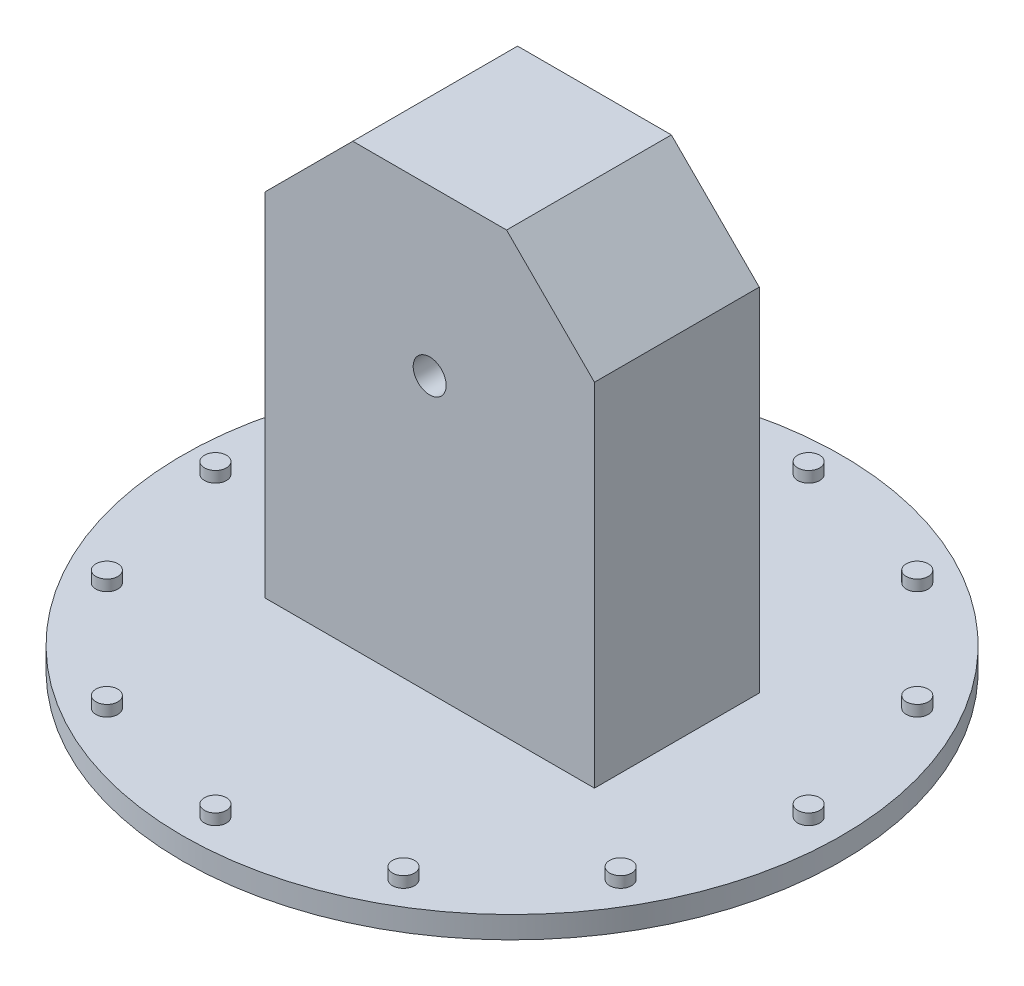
ISO-10303-21;
HEADER;
FILE_DESCRIPTION(('STEP AP214'),'2;1');
FILE_NAME('part.step','',(''),(''),'','','');
FILE_SCHEMA(('AUTOMOTIVE_DESIGN { 1 0 10303 214 1 1 1 1 }'));
ENDSEC;
DATA;
#1=APPLICATION_CONTEXT('core data for automotive mechanical design processes');
#2=APPLICATION_PROTOCOL_DEFINITION('international standard','automotive_design',2000,#1);
#3=PRODUCT_CONTEXT('',#1,'mechanical');
#4=PRODUCT('Part','Part','',(#3));
#5=PRODUCT_RELATED_PRODUCT_CATEGORY('part','',(#4));
#6=PRODUCT_DEFINITION_FORMATION('','',#4);
#7=PRODUCT_DEFINITION_CONTEXT('part definition',#1,'design');
#8=PRODUCT_DEFINITION('design','',#6,#7);
#9=PRODUCT_DEFINITION_SHAPE('','',#8);
#10=(LENGTH_UNIT() NAMED_UNIT(*) SI_UNIT(.MILLI.,.METRE.));
#11=(NAMED_UNIT(*) PLANE_ANGLE_UNIT() SI_UNIT($,.RADIAN.));
#12=(NAMED_UNIT(*) SI_UNIT($,.STERADIAN.) SOLID_ANGLE_UNIT());
#13=UNCERTAINTY_MEASURE_WITH_UNIT(LENGTH_MEASURE(1.E-05),#10,'distance_accuracy_value','');
#14=(GEOMETRIC_REPRESENTATION_CONTEXT(3) GLOBAL_UNCERTAINTY_ASSIGNED_CONTEXT((#13)) GLOBAL_UNIT_ASSIGNED_CONTEXT((#10,
#11,#12)) REPRESENTATION_CONTEXT('',''));
#15=CARTESIAN_POINT('',(0.,0.,0.));
#16=DIRECTION('',(0.,0.,1.));
#17=DIRECTION('',(1.,0.,0.));
#18=AXIS2_PLACEMENT_3D('',#15,#16,#17);
#19=CARTESIAN_POINT('',(0.,0.,0.));
#20=DIRECTION('',(0.,1.,0.));
#21=DIRECTION('',(0.,0.,1.));
#22=AXIS2_PLACEMENT_3D('',#19,#20,#21);
#23=PLANE('',#22);
#24=CARTESIAN_POINT('',(-134.999999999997,0.,233.8268590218));
#25=DIRECTION('',(0.,1.,0.));
#26=DIRECTION('',(-0.499999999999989,0.,0.866025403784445));
#27=AXIS2_PLACEMENT_3D('',#24,#25,#26);
#28=CIRCLE('',#27,10.);
#29=CARTESIAN_POINT('',(-139.999999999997,0.,242.487113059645));
#30=VERTEX_POINT('',#29);
#31=EDGE_CURVE('E129',#30,#30,#28,.T.);
#32=ORIENTED_EDGE('',*,*,#31,.F.);
#33=EDGE_LOOP('',(#32));
#34=FACE_BOUND('',#33,.T.);
#35=CARTESIAN_POINT('',(-233.826859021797,0.,135.000000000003));
#36=DIRECTION('',(0.,1.,0.));
#37=DIRECTION('',(-0.866025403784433,0.,0.50000000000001));
#38=AXIS2_PLACEMENT_3D('',#35,#36,#37);
#39=CIRCLE('',#38,10.);
#40=CARTESIAN_POINT('',(-242.487113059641,0.,140.000000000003));
#41=VERTEX_POINT('',#40);
#42=EDGE_CURVE('E133',#41,#41,#39,.T.);
#43=ORIENTED_EDGE('',*,*,#42,.F.);
#44=EDGE_LOOP('',(#43));
#45=FACE_BOUND('',#44,.T.);
#46=CARTESIAN_POINT('',(-270.,0.,2.82809988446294E-12));
#47=DIRECTION('',(0.,1.,0.));
#48=DIRECTION('',(-1.,0.,0.));
#49=AXIS2_PLACEMENT_3D('',#46,#47,#48);
#50=CIRCLE('',#49,10.);
#51=CARTESIAN_POINT('',(-280.,0.,2.93284432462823E-12));
#52=VERTEX_POINT('',#51);
#53=EDGE_CURVE('E139',#52,#52,#50,.T.);
#54=ORIENTED_EDGE('',*,*,#53,.F.);
#55=EDGE_LOOP('',(#54));
#56=FACE_BOUND('',#55,.T.);
#57=CARTESIAN_POINT('',(-233.8268590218,0.,-134.999999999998));
#58=DIRECTION('',(0.,1.,0.));
#59=DIRECTION('',(-0.866025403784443,0.,-0.499999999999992));
#60=AXIS2_PLACEMENT_3D('',#57,#58,#59);
#61=CIRCLE('',#60,10.);
#62=CARTESIAN_POINT('',(-242.487113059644,0.,-139.999999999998));
#63=VERTEX_POINT('',#62);
#64=EDGE_CURVE('E145',#63,#63,#61,.T.);
#65=ORIENTED_EDGE('',*,*,#64,.F.);
#66=EDGE_LOOP('',(#65));
#67=FACE_BOUND('',#66,.T.);
#68=CARTESIAN_POINT('',(-135.000000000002,0.,-233.826859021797));
#69=DIRECTION('',(0.,1.,0.));
#70=DIRECTION('',(-0.500000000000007,0.,-0.866025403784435));
#71=AXIS2_PLACEMENT_3D('',#68,#69,#70);
#72=CIRCLE('',#71,10.);
#73=CARTESIAN_POINT('',(-140.000000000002,0.,-242.487113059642));
#74=VERTEX_POINT('',#73);
#75=EDGE_CURVE('E151',#74,#74,#72,.T.);
#76=ORIENTED_EDGE('',*,*,#75,.F.);
#77=EDGE_LOOP('',(#76));
#78=FACE_BOUND('',#77,.T.);
#79=CARTESIAN_POINT('',(0.,0.,-270.));
#80=DIRECTION('',(0.,1.,0.));
#81=DIRECTION('',(0.,0.,-1.));
#82=AXIS2_PLACEMENT_3D('',#79,#80,#81);
#83=CIRCLE('',#82,10.);
#84=CARTESIAN_POINT('',(0.,0.,-280.));
#85=VERTEX_POINT('',#84);
#86=EDGE_CURVE('E157',#85,#85,#83,.T.);
#87=ORIENTED_EDGE('',*,*,#86,.F.);
#88=EDGE_LOOP('',(#87));
#89=FACE_BOUND('',#88,.T.);
#90=CARTESIAN_POINT('',(134.999999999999,0.,-233.826859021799));
#91=DIRECTION('',(0.,1.,0.));
#92=DIRECTION('',(0.499999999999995,0.,-0.866025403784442));
#93=AXIS2_PLACEMENT_3D('',#90,#91,#92);
#94=CIRCLE('',#93,10.);
#95=CARTESIAN_POINT('',(139.999999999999,0.,-242.487113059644));
#96=VERTEX_POINT('',#95);
#97=EDGE_CURVE('E163',#96,#96,#94,.T.);
#98=ORIENTED_EDGE('',*,*,#97,.F.);
#99=EDGE_LOOP('',(#98));
#100=FACE_BOUND('',#99,.T.);
#101=CARTESIAN_POINT('',(233.826859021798,0.,-135.000000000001));
#102=DIRECTION('',(0.,1.,0.));
#103=DIRECTION('',(0.866025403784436,0.,-0.500000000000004));
#104=AXIS2_PLACEMENT_3D('',#101,#102,#103);
#105=CIRCLE('',#104,10.);
#106=CARTESIAN_POINT('',(242.487113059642,0.,-140.000000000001));
#107=VERTEX_POINT('',#106);
#108=EDGE_CURVE('E169',#107,#107,#105,.T.);
#109=ORIENTED_EDGE('',*,*,#108,.F.);
#110=EDGE_LOOP('',(#109));
#111=FACE_BOUND('',#110,.T.);
#112=CARTESIAN_POINT('',(270.,0.,-9.42699961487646E-13));
#113=DIRECTION('',(0.,1.,0.));
#114=DIRECTION('',(1.,0.,0.));
#115=AXIS2_PLACEMENT_3D('',#112,#113,#114);
#116=CIRCLE('',#115,10.);
#117=CARTESIAN_POINT('',(280.,0.,-9.77614774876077E-13));
#118=VERTEX_POINT('',#117);
#119=EDGE_CURVE('E175',#118,#118,#116,.T.);
#120=ORIENTED_EDGE('',*,*,#119,.F.);
#121=EDGE_LOOP('',(#120));
#122=FACE_BOUND('',#121,.T.);
#123=CARTESIAN_POINT('',(233.826859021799,0.,134.999999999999));
#124=DIRECTION('',(0.,1.,0.));
#125=DIRECTION('',(0.86602540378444,0.,0.499999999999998));
#126=AXIS2_PLACEMENT_3D('',#123,#124,#125);
#127=CIRCLE('',#126,10.);
#128=CARTESIAN_POINT('',(242.487113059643,0.,139.999999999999));
#129=VERTEX_POINT('',#128);
#130=EDGE_CURVE('E181',#129,#129,#127,.T.);
#131=ORIENTED_EDGE('',*,*,#130,.F.);
#132=EDGE_LOOP('',(#131));
#133=FACE_BOUND('',#132,.T.);
#134=CARTESIAN_POINT('',(135.,0.,233.826859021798));
#135=DIRECTION('',(0.,1.,0.));
#136=DIRECTION('',(0.500000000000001,0.,0.866025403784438));
#137=AXIS2_PLACEMENT_3D('',#134,#135,#136);
#138=CIRCLE('',#137,10.);
#139=CARTESIAN_POINT('',(140.,0.,242.487113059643));
#140=VERTEX_POINT('',#139);
#141=EDGE_CURVE('E187',#140,#140,#138,.T.);
#142=ORIENTED_EDGE('',*,*,#141,.F.);
#143=EDGE_LOOP('',(#142));
#144=FACE_BOUND('',#143,.T.);
#145=CARTESIAN_POINT('',(0.,0.,270.));
#146=DIRECTION('',(0.,1.,0.));
#147=DIRECTION('',(0.,0.,1.));
#148=AXIS2_PLACEMENT_3D('',#145,#146,#147);
#149=CIRCLE('',#148,10.);
#150=CARTESIAN_POINT('',(0.,0.,280.));
#151=VERTEX_POINT('',#150);
#152=EDGE_CURVE('E193',#151,#151,#149,.T.);
#153=ORIENTED_EDGE('',*,*,#152,.F.);
#154=EDGE_LOOP('',(#153));
#155=FACE_BOUND('',#154,.T.);
#156=CARTESIAN_POINT('',(0.,0.,0.));
#157=DIRECTION('',(0.,1.,0.));
#158=DIRECTION('',(0.,0.,1.));
#159=AXIS2_PLACEMENT_3D('',#156,#157,#158);
#160=CIRCLE('',#159,300.);
#161=CARTESIAN_POINT('',(0.,0.,300.));
#162=VERTEX_POINT('',#161);
#163=EDGE_CURVE('E199',#162,#162,#160,.T.);
#164=ORIENTED_EDGE('',*,*,#163,.T.);
#165=EDGE_LOOP('',(#164));
#166=FACE_BOUND('',#165,.T.);
#167=DIRECTION('',(1.,0.,0.));
#168=VECTOR('',#167,1.);
#169=CARTESIAN_POINT('',(-150.,0.,75.));
#170=LINE('',#169,#168);
#171=CARTESIAN_POINT('',(-150.,0.,75.));
#172=VERTEX_POINT('',#171);
#173=CARTESIAN_POINT('',(150.,0.,75.));
#174=VERTEX_POINT('',#173);
#175=EDGE_CURVE('E116',#172,#174,#170,.T.);
#176=ORIENTED_EDGE('',*,*,#175,.F.);
#177=DIRECTION('',(0.,0.,1.));
#178=VECTOR('',#177,1.);
#179=CARTESIAN_POINT('',(-150.,0.,75.));
#180=LINE('',#179,#178);
#181=CARTESIAN_POINT('',(-150.,0.,-75.));
#182=VERTEX_POINT('',#181);
#183=EDGE_CURVE('E113',#182,#172,#180,.T.);
#184=ORIENTED_EDGE('',*,*,#183,.F.);
#185=DIRECTION('',(-1.,0.,0.));
#186=VECTOR('',#185,1.);
#187=CARTESIAN_POINT('',(-150.,0.,-75.));
#188=LINE('',#187,#186);
#189=CARTESIAN_POINT('',(150.,0.,-75.));
#190=VERTEX_POINT('',#189);
#191=EDGE_CURVE('E109',#190,#182,#188,.T.);
#192=ORIENTED_EDGE('',*,*,#191,.F.);
#193=DIRECTION('',(0.,0.,-1.));
#194=VECTOR('',#193,1.);
#195=CARTESIAN_POINT('',(150.,0.,75.));
#196=LINE('',#195,#194);
#197=EDGE_CURVE('E120',#174,#190,#196,.T.);
#198=ORIENTED_EDGE('',*,*,#197,.F.);
#199=EDGE_LOOP('',(#176,#184,#192,#198));
#200=FACE_BOUND('',#199,.T.);
#201=ADVANCED_FACE('F36',(#34,#45,#56,#67,#78,#89,#100,#111,#122,#133,#144,#155,#166,#200),#23,.T.);
#202=CARTESIAN_POINT('',(0.,-20.,0.));
#203=DIRECTION('',(0.,1.,0.));
#204=DIRECTION('',(0.,0.,1.));
#205=AXIS2_PLACEMENT_3D('',#202,#203,#204);
#206=CYLINDRICAL_SURFACE('',#205,300.);
#207=CARTESIAN_POINT('',(0.,-20.,0.));
#208=DIRECTION('',(0.,1.,0.));
#209=DIRECTION('',(0.,0.,1.));
#210=AXIS2_PLACEMENT_3D('',#207,#208,#209);
#211=CIRCLE('',#210,300.);
#212=CARTESIAN_POINT('',(0.,-20.,300.));
#213=VERTEX_POINT('',#212);
#214=EDGE_CURVE('E93',#213,#213,#211,.T.);
#215=ORIENTED_EDGE('',*,*,#214,.T.);
#216=EDGE_LOOP('',(#215));
#217=FACE_BOUND('',#216,.T.);
#218=ORIENTED_EDGE('',*,*,#163,.F.);
#219=EDGE_LOOP('',(#218));
#220=FACE_BOUND('',#219,.T.);
#221=ADVANCED_FACE('F38',(#217,#220),#206,.T.);
#222=CARTESIAN_POINT('',(0.,-20.,0.));
#223=DIRECTION('',(0.,1.,0.));
#224=DIRECTION('',(0.,0.,1.));
#225=AXIS2_PLACEMENT_3D('',#222,#223,#224);
#226=PLANE('',#225);
#227=ORIENTED_EDGE('',*,*,#214,.F.);
#228=EDGE_LOOP('',(#227));
#229=FACE_BOUND('',#228,.T.);
#230=ADVANCED_FACE('F210',(#229),#226,.F.);
#231=CARTESIAN_POINT('',(0.,10.,270.));
#232=DIRECTION('',(0.,-1.,0.));
#233=DIRECTION('',(0.,0.,-1.));
#234=AXIS2_PLACEMENT_3D('',#231,#232,#233);
#235=CYLINDRICAL_SURFACE('',#234,10.);
#236=CARTESIAN_POINT('',(0.,10.,270.));
#237=DIRECTION('',(0.,1.,0.));
#238=DIRECTION('',(0.,0.,1.));
#239=AXIS2_PLACEMENT_3D('',#236,#237,#238);
#240=CIRCLE('',#239,10.);
#241=CARTESIAN_POINT('',(0.,10.,280.));
#242=VERTEX_POINT('',#241);
#243=EDGE_CURVE('E196',#242,#242,#240,.T.);
#244=ORIENTED_EDGE('',*,*,#243,.F.);
#245=EDGE_LOOP('',(#244));
#246=FACE_BOUND('',#245,.T.);
#247=ORIENTED_EDGE('',*,*,#152,.T.);
#248=EDGE_LOOP('',(#247));
#249=FACE_BOUND('',#248,.T.);
#250=ADVANCED_FACE('F216',(#246,#249),#235,.T.);
#251=CARTESIAN_POINT('',(0.,10.,270.));
#252=DIRECTION('',(0.,1.,0.));
#253=DIRECTION('',(0.,0.,1.));
#254=AXIS2_PLACEMENT_3D('',#251,#252,#253);
#255=PLANE('',#254);
#256=ORIENTED_EDGE('',*,*,#243,.T.);
#257=EDGE_LOOP('',(#256));
#258=FACE_BOUND('',#257,.T.);
#259=ADVANCED_FACE('F228',(#258),#255,.T.);
#260=CARTESIAN_POINT('',(135.,10.,233.826859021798));
#261=DIRECTION('',(0.,-1.,0.));
#262=DIRECTION('',(0.,0.,-1.));
#263=AXIS2_PLACEMENT_3D('',#260,#261,#262);
#264=CYLINDRICAL_SURFACE('',#263,10.);
#265=CARTESIAN_POINT('',(135.,10.,233.826859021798));
#266=DIRECTION('',(0.,1.,0.));
#267=DIRECTION('',(0.500000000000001,0.,0.866025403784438));
#268=AXIS2_PLACEMENT_3D('',#265,#266,#267);
#269=CIRCLE('',#268,10.);
#270=CARTESIAN_POINT('',(140.,10.,242.487113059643));
#271=VERTEX_POINT('',#270);
#272=EDGE_CURVE('E190',#271,#271,#269,.T.);
#273=ORIENTED_EDGE('',*,*,#272,.F.);
#274=EDGE_LOOP('',(#273));
#275=FACE_BOUND('',#274,.T.);
#276=ORIENTED_EDGE('',*,*,#141,.T.);
#277=EDGE_LOOP('',(#276));
#278=FACE_BOUND('',#277,.T.);
#279=ADVANCED_FACE('F232',(#275,#278),#264,.T.);
#280=CARTESIAN_POINT('',(135.,10.,233.826859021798));
#281=DIRECTION('',(0.,1.,0.));
#282=DIRECTION('',(0.500000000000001,0.,0.866025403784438));
#283=AXIS2_PLACEMENT_3D('',#280,#281,#282);
#284=PLANE('',#283);
#285=ORIENTED_EDGE('',*,*,#272,.T.);
#286=EDGE_LOOP('',(#285));
#287=FACE_BOUND('',#286,.T.);
#288=ADVANCED_FACE('F236',(#287),#284,.T.);
#289=CARTESIAN_POINT('',(233.826859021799,10.,134.999999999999));
#290=DIRECTION('',(0.,-1.,0.));
#291=DIRECTION('',(0.,0.,-1.));
#292=AXIS2_PLACEMENT_3D('',#289,#290,#291);
#293=CYLINDRICAL_SURFACE('',#292,10.);
#294=CARTESIAN_POINT('',(233.826859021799,10.,134.999999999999));
#295=DIRECTION('',(0.,1.,0.));
#296=DIRECTION('',(0.86602540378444,0.,0.499999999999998));
#297=AXIS2_PLACEMENT_3D('',#294,#295,#296);
#298=CIRCLE('',#297,10.);
#299=CARTESIAN_POINT('',(242.487113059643,10.,139.999999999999));
#300=VERTEX_POINT('',#299);
#301=EDGE_CURVE('E184',#300,#300,#298,.T.);
#302=ORIENTED_EDGE('',*,*,#301,.F.);
#303=EDGE_LOOP('',(#302));
#304=FACE_BOUND('',#303,.T.);
#305=ORIENTED_EDGE('',*,*,#130,.T.);
#306=EDGE_LOOP('',(#305));
#307=FACE_BOUND('',#306,.T.);
#308=ADVANCED_FACE('F240',(#304,#307),#293,.T.);
#309=CARTESIAN_POINT('',(233.826859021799,10.,134.999999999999));
#310=DIRECTION('',(0.,1.,0.));
#311=DIRECTION('',(0.86602540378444,0.,0.499999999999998));
#312=AXIS2_PLACEMENT_3D('',#309,#310,#311);
#313=PLANE('',#312);
#314=ORIENTED_EDGE('',*,*,#301,.T.);
#315=EDGE_LOOP('',(#314));
#316=FACE_BOUND('',#315,.T.);
#317=ADVANCED_FACE('F244',(#316),#313,.T.);
#318=CARTESIAN_POINT('',(270.,10.,-9.42699961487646E-13));
#319=DIRECTION('',(0.,-1.,0.));
#320=DIRECTION('',(0.,0.,-1.));
#321=AXIS2_PLACEMENT_3D('',#318,#319,#320);
#322=CYLINDRICAL_SURFACE('',#321,10.);
#323=CARTESIAN_POINT('',(270.,10.,-9.42699961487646E-13));
#324=DIRECTION('',(0.,1.,0.));
#325=DIRECTION('',(1.,0.,0.));
#326=AXIS2_PLACEMENT_3D('',#323,#324,#325);
#327=CIRCLE('',#326,10.);
#328=CARTESIAN_POINT('',(280.,10.,-9.77614774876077E-13));
#329=VERTEX_POINT('',#328);
#330=EDGE_CURVE('E178',#329,#329,#327,.T.);
#331=ORIENTED_EDGE('',*,*,#330,.F.);
#332=EDGE_LOOP('',(#331));
#333=FACE_BOUND('',#332,.T.);
#334=ORIENTED_EDGE('',*,*,#119,.T.);
#335=EDGE_LOOP('',(#334));
#336=FACE_BOUND('',#335,.T.);
#337=ADVANCED_FACE('F248',(#333,#336),#322,.T.);
#338=CARTESIAN_POINT('',(270.,10.,-9.42699961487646E-13));
#339=DIRECTION('',(0.,1.,0.));
#340=DIRECTION('',(1.,0.,0.));
#341=AXIS2_PLACEMENT_3D('',#338,#339,#340);
#342=PLANE('',#341);
#343=ORIENTED_EDGE('',*,*,#330,.T.);
#344=EDGE_LOOP('',(#343));
#345=FACE_BOUND('',#344,.T.);
#346=ADVANCED_FACE('F252',(#345),#342,.T.);
#347=CARTESIAN_POINT('',(233.826859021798,10.,-135.000000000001));
#348=DIRECTION('',(0.,-1.,0.));
#349=DIRECTION('',(0.,0.,-1.));
#350=AXIS2_PLACEMENT_3D('',#347,#348,#349);
#351=CYLINDRICAL_SURFACE('',#350,10.);
#352=CARTESIAN_POINT('',(233.826859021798,10.,-135.000000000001));
#353=DIRECTION('',(0.,1.,0.));
#354=DIRECTION('',(0.866025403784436,0.,-0.500000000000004));
#355=AXIS2_PLACEMENT_3D('',#352,#353,#354);
#356=CIRCLE('',#355,10.);
#357=CARTESIAN_POINT('',(242.487113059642,10.,-140.000000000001));
#358=VERTEX_POINT('',#357);
#359=EDGE_CURVE('E172',#358,#358,#356,.T.);
#360=ORIENTED_EDGE('',*,*,#359,.F.);
#361=EDGE_LOOP('',(#360));
#362=FACE_BOUND('',#361,.T.);
#363=ORIENTED_EDGE('',*,*,#108,.T.);
#364=EDGE_LOOP('',(#363));
#365=FACE_BOUND('',#364,.T.);
#366=ADVANCED_FACE('F256',(#362,#365),#351,.T.);
#367=CARTESIAN_POINT('',(233.826859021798,10.,-135.000000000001));
#368=DIRECTION('',(0.,1.,0.));
#369=DIRECTION('',(0.866025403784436,0.,-0.500000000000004));
#370=AXIS2_PLACEMENT_3D('',#367,#368,#369);
#371=PLANE('',#370);
#372=ORIENTED_EDGE('',*,*,#359,.T.);
#373=EDGE_LOOP('',(#372));
#374=FACE_BOUND('',#373,.T.);
#375=ADVANCED_FACE('F260',(#374),#371,.T.);
#376=CARTESIAN_POINT('',(134.999999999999,10.,-233.826859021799));
#377=DIRECTION('',(0.,-1.,0.));
#378=DIRECTION('',(0.,0.,-1.));
#379=AXIS2_PLACEMENT_3D('',#376,#377,#378);
#380=CYLINDRICAL_SURFACE('',#379,10.);
#381=CARTESIAN_POINT('',(134.999999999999,10.,-233.826859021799));
#382=DIRECTION('',(0.,1.,0.));
#383=DIRECTION('',(0.499999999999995,0.,-0.866025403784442));
#384=AXIS2_PLACEMENT_3D('',#381,#382,#383);
#385=CIRCLE('',#384,10.);
#386=CARTESIAN_POINT('',(139.999999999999,10.,-242.487113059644));
#387=VERTEX_POINT('',#386);
#388=EDGE_CURVE('E166',#387,#387,#385,.T.);
#389=ORIENTED_EDGE('',*,*,#388,.F.);
#390=EDGE_LOOP('',(#389));
#391=FACE_BOUND('',#390,.T.);
#392=ORIENTED_EDGE('',*,*,#97,.T.);
#393=EDGE_LOOP('',(#392));
#394=FACE_BOUND('',#393,.T.);
#395=ADVANCED_FACE('F264',(#391,#394),#380,.T.);
#396=CARTESIAN_POINT('',(134.999999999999,10.,-233.826859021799));
#397=DIRECTION('',(0.,1.,0.));
#398=DIRECTION('',(0.499999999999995,0.,-0.866025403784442));
#399=AXIS2_PLACEMENT_3D('',#396,#397,#398);
#400=PLANE('',#399);
#401=ORIENTED_EDGE('',*,*,#388,.T.);
#402=EDGE_LOOP('',(#401));
#403=FACE_BOUND('',#402,.T.);
#404=ADVANCED_FACE('F268',(#403),#400,.T.);
#405=CARTESIAN_POINT('',(0.,10.,-270.));
#406=DIRECTION('',(0.,-1.,0.));
#407=DIRECTION('',(0.,0.,-1.));
#408=AXIS2_PLACEMENT_3D('',#405,#406,#407);
#409=CYLINDRICAL_SURFACE('',#408,10.);
#410=CARTESIAN_POINT('',(0.,10.,-270.));
#411=DIRECTION('',(0.,1.,0.));
#412=DIRECTION('',(0.,0.,-1.));
#413=AXIS2_PLACEMENT_3D('',#410,#411,#412);
#414=CIRCLE('',#413,10.);
#415=CARTESIAN_POINT('',(0.,10.,-280.));
#416=VERTEX_POINT('',#415);
#417=EDGE_CURVE('E160',#416,#416,#414,.T.);
#418=ORIENTED_EDGE('',*,*,#417,.F.);
#419=EDGE_LOOP('',(#418));
#420=FACE_BOUND('',#419,.T.);
#421=ORIENTED_EDGE('',*,*,#86,.T.);
#422=EDGE_LOOP('',(#421));
#423=FACE_BOUND('',#422,.T.);
#424=ADVANCED_FACE('F272',(#420,#423),#409,.T.);
#425=CARTESIAN_POINT('',(0.,10.,-270.));
#426=DIRECTION('',(0.,1.,0.));
#427=DIRECTION('',(0.,0.,-1.));
#428=AXIS2_PLACEMENT_3D('',#425,#426,#427);
#429=PLANE('',#428);
#430=ORIENTED_EDGE('',*,*,#417,.T.);
#431=EDGE_LOOP('',(#430));
#432=FACE_BOUND('',#431,.T.);
#433=ADVANCED_FACE('F276',(#432),#429,.T.);
#434=CARTESIAN_POINT('',(-135.000000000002,10.,-233.826859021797));
#435=DIRECTION('',(0.,-1.,0.));
#436=DIRECTION('',(0.,0.,-1.));
#437=AXIS2_PLACEMENT_3D('',#434,#435,#436);
#438=CYLINDRICAL_SURFACE('',#437,10.);
#439=CARTESIAN_POINT('',(-135.000000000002,10.,-233.826859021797));
#440=DIRECTION('',(0.,1.,0.));
#441=DIRECTION('',(-0.500000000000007,0.,-0.866025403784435));
#442=AXIS2_PLACEMENT_3D('',#439,#440,#441);
#443=CIRCLE('',#442,10.);
#444=CARTESIAN_POINT('',(-140.000000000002,10.,-242.487113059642));
#445=VERTEX_POINT('',#444);
#446=EDGE_CURVE('E154',#445,#445,#443,.T.);
#447=ORIENTED_EDGE('',*,*,#446,.F.);
#448=EDGE_LOOP('',(#447));
#449=FACE_BOUND('',#448,.T.);
#450=ORIENTED_EDGE('',*,*,#75,.T.);
#451=EDGE_LOOP('',(#450));
#452=FACE_BOUND('',#451,.T.);
#453=ADVANCED_FACE('F280',(#449,#452),#438,.T.);
#454=CARTESIAN_POINT('',(-135.000000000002,10.,-233.826859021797));
#455=DIRECTION('',(0.,1.,0.));
#456=DIRECTION('',(-0.500000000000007,0.,-0.866025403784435));
#457=AXIS2_PLACEMENT_3D('',#454,#455,#456);
#458=PLANE('',#457);
#459=ORIENTED_EDGE('',*,*,#446,.T.);
#460=EDGE_LOOP('',(#459));
#461=FACE_BOUND('',#460,.T.);
#462=ADVANCED_FACE('F284',(#461),#458,.T.);
#463=CARTESIAN_POINT('',(-233.8268590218,10.,-134.999999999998));
#464=DIRECTION('',(0.,-1.,0.));
#465=DIRECTION('',(0.,0.,-1.));
#466=AXIS2_PLACEMENT_3D('',#463,#464,#465);
#467=CYLINDRICAL_SURFACE('',#466,10.);
#468=CARTESIAN_POINT('',(-233.8268590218,10.,-134.999999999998));
#469=DIRECTION('',(0.,1.,0.));
#470=DIRECTION('',(-0.866025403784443,0.,-0.499999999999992));
#471=AXIS2_PLACEMENT_3D('',#468,#469,#470);
#472=CIRCLE('',#471,10.);
#473=CARTESIAN_POINT('',(-242.487113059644,10.,-139.999999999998));
#474=VERTEX_POINT('',#473);
#475=EDGE_CURVE('E148',#474,#474,#472,.T.);
#476=ORIENTED_EDGE('',*,*,#475,.F.);
#477=EDGE_LOOP('',(#476));
#478=FACE_BOUND('',#477,.T.);
#479=ORIENTED_EDGE('',*,*,#64,.T.);
#480=EDGE_LOOP('',(#479));
#481=FACE_BOUND('',#480,.T.);
#482=ADVANCED_FACE('F288',(#478,#481),#467,.T.);
#483=CARTESIAN_POINT('',(-233.8268590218,10.,-134.999999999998));
#484=DIRECTION('',(0.,1.,0.));
#485=DIRECTION('',(-0.866025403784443,0.,-0.499999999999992));
#486=AXIS2_PLACEMENT_3D('',#483,#484,#485);
#487=PLANE('',#486);
#488=ORIENTED_EDGE('',*,*,#475,.T.);
#489=EDGE_LOOP('',(#488));
#490=FACE_BOUND('',#489,.T.);
#491=ADVANCED_FACE('F292',(#490),#487,.T.);
#492=CARTESIAN_POINT('',(-270.,10.,2.82809988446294E-12));
#493=DIRECTION('',(0.,-1.,0.));
#494=DIRECTION('',(0.,0.,-1.));
#495=AXIS2_PLACEMENT_3D('',#492,#493,#494);
#496=CYLINDRICAL_SURFACE('',#495,10.);
#497=CARTESIAN_POINT('',(-270.,10.,2.82809988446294E-12));
#498=DIRECTION('',(0.,1.,0.));
#499=DIRECTION('',(-1.,0.,0.));
#500=AXIS2_PLACEMENT_3D('',#497,#498,#499);
#501=CIRCLE('',#500,10.);
#502=CARTESIAN_POINT('',(-280.,10.,2.93284432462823E-12));
#503=VERTEX_POINT('',#502);
#504=EDGE_CURVE('E142',#503,#503,#501,.T.);
#505=ORIENTED_EDGE('',*,*,#504,.F.);
#506=EDGE_LOOP('',(#505));
#507=FACE_BOUND('',#506,.T.);
#508=ORIENTED_EDGE('',*,*,#53,.T.);
#509=EDGE_LOOP('',(#508));
#510=FACE_BOUND('',#509,.T.);
#511=ADVANCED_FACE('F296',(#507,#510),#496,.T.);
#512=CARTESIAN_POINT('',(-270.,10.,2.82809988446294E-12));
#513=DIRECTION('',(0.,1.,0.));
#514=DIRECTION('',(-1.,0.,0.));
#515=AXIS2_PLACEMENT_3D('',#512,#513,#514);
#516=PLANE('',#515);
#517=ORIENTED_EDGE('',*,*,#504,.T.);
#518=EDGE_LOOP('',(#517));
#519=FACE_BOUND('',#518,.T.);
#520=ADVANCED_FACE('F300',(#519),#516,.T.);
#521=CARTESIAN_POINT('',(-233.826859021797,10.,135.000000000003));
#522=DIRECTION('',(0.,-1.,0.));
#523=DIRECTION('',(0.,0.,-1.));
#524=AXIS2_PLACEMENT_3D('',#521,#522,#523);
#525=CYLINDRICAL_SURFACE('',#524,10.);
#526=CARTESIAN_POINT('',(-233.826859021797,10.,135.000000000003));
#527=DIRECTION('',(0.,1.,0.));
#528=DIRECTION('',(-0.866025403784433,0.,0.50000000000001));
#529=AXIS2_PLACEMENT_3D('',#526,#527,#528);
#530=CIRCLE('',#529,10.);
#531=CARTESIAN_POINT('',(-242.487113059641,10.,140.000000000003));
#532=VERTEX_POINT('',#531);
#533=EDGE_CURVE('E136',#532,#532,#530,.T.);
#534=ORIENTED_EDGE('',*,*,#533,.F.);
#535=EDGE_LOOP('',(#534));
#536=FACE_BOUND('',#535,.T.);
#537=ORIENTED_EDGE('',*,*,#42,.T.);
#538=EDGE_LOOP('',(#537));
#539=FACE_BOUND('',#538,.T.);
#540=ADVANCED_FACE('F304',(#536,#539),#525,.T.);
#541=CARTESIAN_POINT('',(-233.826859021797,10.,135.000000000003));
#542=DIRECTION('',(0.,1.,0.));
#543=DIRECTION('',(-0.866025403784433,0.,0.50000000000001));
#544=AXIS2_PLACEMENT_3D('',#541,#542,#543);
#545=PLANE('',#544);
#546=ORIENTED_EDGE('',*,*,#533,.T.);
#547=EDGE_LOOP('',(#546));
#548=FACE_BOUND('',#547,.T.);
#549=ADVANCED_FACE('F308',(#548),#545,.T.);
#550=CARTESIAN_POINT('',(-134.999999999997,10.,233.8268590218));
#551=DIRECTION('',(0.,-1.,0.));
#552=DIRECTION('',(0.,0.,-1.));
#553=AXIS2_PLACEMENT_3D('',#550,#551,#552);
#554=CYLINDRICAL_SURFACE('',#553,10.);
#555=CARTESIAN_POINT('',(-134.999999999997,10.,233.8268590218));
#556=DIRECTION('',(0.,1.,0.));
#557=DIRECTION('',(-0.499999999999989,0.,0.866025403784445));
#558=AXIS2_PLACEMENT_3D('',#555,#556,#557);
#559=CIRCLE('',#558,10.);
#560=CARTESIAN_POINT('',(-139.999999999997,10.,242.487113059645));
#561=VERTEX_POINT('',#560);
#562=EDGE_CURVE('E130',#561,#561,#559,.T.);
#563=ORIENTED_EDGE('',*,*,#562,.F.);
#564=EDGE_LOOP('',(#563));
#565=FACE_BOUND('',#564,.T.);
#566=ORIENTED_EDGE('',*,*,#31,.T.);
#567=EDGE_LOOP('',(#566));
#568=FACE_BOUND('',#567,.T.);
#569=ADVANCED_FACE('F312',(#565,#568),#554,.T.);
#570=CARTESIAN_POINT('',(-134.999999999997,10.,233.8268590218));
#571=DIRECTION('',(0.,1.,0.));
#572=DIRECTION('',(-0.499999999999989,0.,0.866025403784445));
#573=AXIS2_PLACEMENT_3D('',#570,#571,#572);
#574=PLANE('',#573);
#575=ORIENTED_EDGE('',*,*,#562,.T.);
#576=EDGE_LOOP('',(#575));
#577=FACE_BOUND('',#576,.T.);
#578=ADVANCED_FACE('F316',(#577),#574,.T.);
#579=CARTESIAN_POINT('',(-150.,400.,75.));
#580=DIRECTION('',(1.,0.,0.));
#581=DIRECTION('',(0.,0.,-1.));
#582=AXIS2_PLACEMENT_3D('',#579,#580,#581);
#583=PLANE('',#582);
#584=DIRECTION('',(0.,-1.,0.));
#585=VECTOR('',#584,1.);
#586=CARTESIAN_POINT('',(-150.,400.,75.));
#587=LINE('',#586,#585);
#588=CARTESIAN_POINT('',(-150.,320.,75.));
#589=VERTEX_POINT('',#588);
#590=EDGE_CURVE('E127',#589,#172,#587,.T.);
#591=ORIENTED_EDGE('',*,*,#590,.F.);
#592=DIRECTION('',(0.,0.,1.));
#593=VECTOR('',#592,1.);
#594=CARTESIAN_POINT('',(-150.,320.,-220.));
#595=LINE('',#594,#593);
#596=CARTESIAN_POINT('',(-150.,320.,-75.));
#597=VERTEX_POINT('',#596);
#598=EDGE_CURVE('E102',#597,#589,#595,.T.);
#599=ORIENTED_EDGE('',*,*,#598,.F.);
#600=DIRECTION('',(0.,-1.,0.));
#601=VECTOR('',#600,1.);
#602=CARTESIAN_POINT('',(-150.,400.,-75.));
#603=LINE('',#602,#601);
#604=EDGE_CURVE('E101',#597,#182,#603,.T.);
#605=ORIENTED_EDGE('',*,*,#604,.T.);
#606=ORIENTED_EDGE('',*,*,#183,.T.);
#607=EDGE_LOOP('',(#591,#599,#605,#606));
#608=FACE_BOUND('',#607,.T.);
#609=ADVANCED_FACE('F320',(#608),#583,.F.);
#610=CARTESIAN_POINT('',(-150.,400.,75.));
#611=DIRECTION('',(0.,0.,-1.));
#612=DIRECTION('',(-1.,0.,0.));
#613=AXIS2_PLACEMENT_3D('',#610,#611,#612);
#614=PLANE('',#613);
#615=DIRECTION('',(0.,-1.,0.));
#616=VECTOR('',#615,1.);
#617=CARTESIAN_POINT('',(150.,400.,75.));
#618=LINE('',#617,#616);
#619=CARTESIAN_POINT('',(150.,320.,75.));
#620=VERTEX_POINT('',#619);
#621=EDGE_CURVE('E125',#620,#174,#618,.T.);
#622=ORIENTED_EDGE('',*,*,#621,.F.);
#623=DIRECTION('',(-0.707106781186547,0.707106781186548,0.));
#624=VECTOR('',#623,1.);
#625=CARTESIAN_POINT('',(-40.,510.,75.));
#626=LINE('',#625,#624);
#627=CARTESIAN_POINT('',(70.,400.,75.));
#628=VERTEX_POINT('',#627);
#629=EDGE_CURVE('E117',#620,#628,#626,.T.);
#630=ORIENTED_EDGE('',*,*,#629,.T.);
#631=DIRECTION('',(1.,0.,0.));
#632=VECTOR('',#631,1.);
#633=CARTESIAN_POINT('',(-150.,400.,75.));
#634=LINE('',#633,#632);
#635=CARTESIAN_POINT('',(-70.,400.,75.));
#636=VERTEX_POINT('',#635);
#637=EDGE_CURVE('E105',#636,#628,#634,.T.);
#638=ORIENTED_EDGE('',*,*,#637,.F.);
#639=DIRECTION('',(-0.707106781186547,-0.707106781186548,0.));
#640=VECTOR('',#639,1.);
#641=CARTESIAN_POINT('',(-110.,360.,75.));
#642=LINE('',#641,#640);
#643=EDGE_CURVE('E58',#636,#589,#642,.T.);
#644=ORIENTED_EDGE('',*,*,#643,.T.);
#645=ORIENTED_EDGE('',*,*,#590,.T.);
#646=ORIENTED_EDGE('',*,*,#175,.T.);
#647=EDGE_LOOP('',(#622,#630,#638,#644,#645,#646));
#648=FACE_BOUND('',#647,.T.);
#649=CARTESIAN_POINT('',(0.,250.,75.));
#650=DIRECTION('',(0.,0.,1.));
#651=DIRECTION('',(1.,0.,0.));
#652=AXIS2_PLACEMENT_3D('',#649,#650,#651);
#653=CIRCLE('',#652,15.);
#654=CARTESIAN_POINT('',(15.,250.,75.));
#655=VERTEX_POINT('',#654);
#656=EDGE_CURVE('E350',#655,#655,#653,.T.);
#657=ORIENTED_EDGE('',*,*,#656,.F.);
#658=EDGE_LOOP('',(#657));
#659=FACE_BOUND('',#658,.T.);
#660=ADVANCED_FACE('F324',(#648,#659),#614,.F.);
#661=CARTESIAN_POINT('',(150.,400.,75.));
#662=DIRECTION('',(-1.,0.,0.));
#663=DIRECTION('',(0.,0.,1.));
#664=AXIS2_PLACEMENT_3D('',#661,#662,#663);
#665=PLANE('',#664);
#666=DIRECTION('',(0.,-1.,0.));
#667=VECTOR('',#666,1.);
#668=CARTESIAN_POINT('',(150.,400.,-75.));
#669=LINE('',#668,#667);
#670=CARTESIAN_POINT('',(150.,320.,-75.));
#671=VERTEX_POINT('',#670);
#672=EDGE_CURVE('E107',#671,#190,#669,.T.);
#673=ORIENTED_EDGE('',*,*,#672,.F.);
#674=DIRECTION('',(0.,0.,1.));
#675=VECTOR('',#674,1.);
#676=CARTESIAN_POINT('',(150.,320.,-220.));
#677=LINE('',#676,#675);
#678=EDGE_CURVE('E355',#671,#620,#677,.T.);
#679=ORIENTED_EDGE('',*,*,#678,.T.);
#680=ORIENTED_EDGE('',*,*,#621,.T.);
#681=ORIENTED_EDGE('',*,*,#197,.T.);
#682=EDGE_LOOP('',(#673,#679,#680,#681));
#683=FACE_BOUND('',#682,.T.);
#684=ADVANCED_FACE('F328',(#683),#665,.F.);
#685=CARTESIAN_POINT('',(-150.,400.,-75.));
#686=DIRECTION('',(0.,0.,1.));
#687=DIRECTION('',(1.,0.,0.));
#688=AXIS2_PLACEMENT_3D('',#685,#686,#687);
#689=PLANE('',#688);
#690=DIRECTION('',(-1.,0.,0.));
#691=VECTOR('',#690,1.);
#692=CARTESIAN_POINT('',(-150.,400.,-75.));
#693=LINE('',#692,#691);
#694=CARTESIAN_POINT('',(70.,400.,-75.));
#695=VERTEX_POINT('',#694);
#696=CARTESIAN_POINT('',(-70.,400.,-75.));
#697=VERTEX_POINT('',#696);
#698=EDGE_CURVE('E99',#695,#697,#693,.T.);
#699=ORIENTED_EDGE('',*,*,#698,.F.);
#700=DIRECTION('',(0.707106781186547,-0.707106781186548,0.));
#701=VECTOR('',#700,1.);
#702=CARTESIAN_POINT('',(-40.,510.,-75.));
#703=LINE('',#702,#701);
#704=EDGE_CURVE('E51',#695,#671,#703,.T.);
#705=ORIENTED_EDGE('',*,*,#704,.T.);
#706=ORIENTED_EDGE('',*,*,#672,.T.);
#707=ORIENTED_EDGE('',*,*,#191,.T.);
#708=ORIENTED_EDGE('',*,*,#604,.F.);
#709=DIRECTION('',(0.707106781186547,0.707106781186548,0.));
#710=VECTOR('',#709,1.);
#711=CARTESIAN_POINT('',(-110.,360.,-75.));
#712=LINE('',#711,#710);
#713=EDGE_CURVE('E87',#597,#697,#712,.T.);
#714=ORIENTED_EDGE('',*,*,#713,.T.);
#715=EDGE_LOOP('',(#699,#705,#706,#707,#708,#714));
#716=FACE_BOUND('',#715,.T.);
#717=CARTESIAN_POINT('',(0.,250.,-75.));
#718=DIRECTION('',(0.,0.,1.));
#719=DIRECTION('',(1.,0.,0.));
#720=AXIS2_PLACEMENT_3D('',#717,#718,#719);
#721=CIRCLE('',#720,15.);
#722=CARTESIAN_POINT('',(15.,250.,-75.));
#723=VERTEX_POINT('',#722);
#724=EDGE_CURVE('E353',#723,#723,#721,.T.);
#725=ORIENTED_EDGE('',*,*,#724,.T.);
#726=EDGE_LOOP('',(#725));
#727=FACE_BOUND('',#726,.T.);
#728=ADVANCED_FACE('F97',(#716,#727),#689,.F.);
#729=CARTESIAN_POINT('',(0.,400.,0.));
#730=DIRECTION('',(0.,-1.,0.));
#731=DIRECTION('',(0.,0.,-1.));
#732=AXIS2_PLACEMENT_3D('',#729,#730,#731);
#733=PLANE('',#732);
#734=ORIENTED_EDGE('',*,*,#637,.T.);
#735=DIRECTION('',(0.,0.,-1.));
#736=VECTOR('',#735,1.);
#737=CARTESIAN_POINT('',(70.,400.,0.));
#738=LINE('',#737,#736);
#739=EDGE_CURVE('E11',#628,#695,#738,.T.);
#740=ORIENTED_EDGE('',*,*,#739,.T.);
#741=ORIENTED_EDGE('',*,*,#698,.T.);
#742=DIRECTION('',(0.,0.,1.));
#743=VECTOR('',#742,1.);
#744=CARTESIAN_POINT('',(-70.,400.,0.));
#745=LINE('',#744,#743);
#746=EDGE_CURVE('E44',#697,#636,#745,.T.);
#747=ORIENTED_EDGE('',*,*,#746,.T.);
#748=EDGE_LOOP('',(#734,#740,#741,#747));
#749=FACE_BOUND('',#748,.T.);
#750=ADVANCED_FACE('F104',(#749),#733,.F.);
#751=CARTESIAN_POINT('',(-150.,320.,-220.));
#752=DIRECTION('',(0.707106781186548,-0.707106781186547,0.));
#753=DIRECTION('',(0.707106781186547,0.707106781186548,0.));
#754=AXIS2_PLACEMENT_3D('',#751,#752,#753);
#755=PLANE('',#754);
#756=ORIENTED_EDGE('',*,*,#746,.F.);
#757=ORIENTED_EDGE('',*,*,#713,.F.);
#758=ORIENTED_EDGE('',*,*,#598,.T.);
#759=ORIENTED_EDGE('',*,*,#643,.F.);
#760=EDGE_LOOP('',(#756,#757,#758,#759));
#761=FACE_BOUND('',#760,.T.);
#762=ADVANCED_FACE('F86',(#761),#755,.F.);
#763=CARTESIAN_POINT('',(70.,400.,-220.));
#764=DIRECTION('',(-0.707106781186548,-0.707106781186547,0.));
#765=DIRECTION('',(0.707106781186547,-0.707106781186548,0.));
#766=AXIS2_PLACEMENT_3D('',#763,#764,#765);
#767=PLANE('',#766);
#768=ORIENTED_EDGE('',*,*,#678,.F.);
#769=ORIENTED_EDGE('',*,*,#704,.F.);
#770=ORIENTED_EDGE('',*,*,#739,.F.);
#771=ORIENTED_EDGE('',*,*,#629,.F.);
#772=EDGE_LOOP('',(#768,#769,#770,#771));
#773=FACE_BOUND('',#772,.T.);
#774=ADVANCED_FACE('F337',(#773),#767,.F.);
#775=CARTESIAN_POINT('',(0.,250.,75.));
#776=DIRECTION('',(0.,0.,-1.));
#777=DIRECTION('',(-1.,0.,0.));
#778=AXIS2_PLACEMENT_3D('',#775,#776,#777);
#779=CYLINDRICAL_SURFACE('',#778,15.);
#780=ORIENTED_EDGE('',*,*,#656,.T.);
#781=EDGE_LOOP('',(#780));
#782=FACE_BOUND('',#781,.T.);
#783=ORIENTED_EDGE('',*,*,#724,.F.);
#784=EDGE_LOOP('',(#783));
#785=FACE_BOUND('',#784,.T.);
#786=ADVANCED_FACE('F340',(#782,#785),#779,.F.);
#787=CLOSED_SHELL('',(#201,#221,#230,#250,#259,#279,#288,#308,#317,#337,#346,#366,#375,#395,
#404,#424,#433,#453,#462,#482,#491,#511,#520,#540,#549,#569,#578,#609,#660,#684,#728,#750,#762,
#774,#786));
#788=MANIFOLD_SOLID_BREP('B2',#787);
#789=ADVANCED_BREP_SHAPE_REPRESENTATION('',(#18,#788),#14);
#790=SHAPE_DEFINITION_REPRESENTATION(#9,#789);
ENDSEC;
END-ISO-10303-21;
